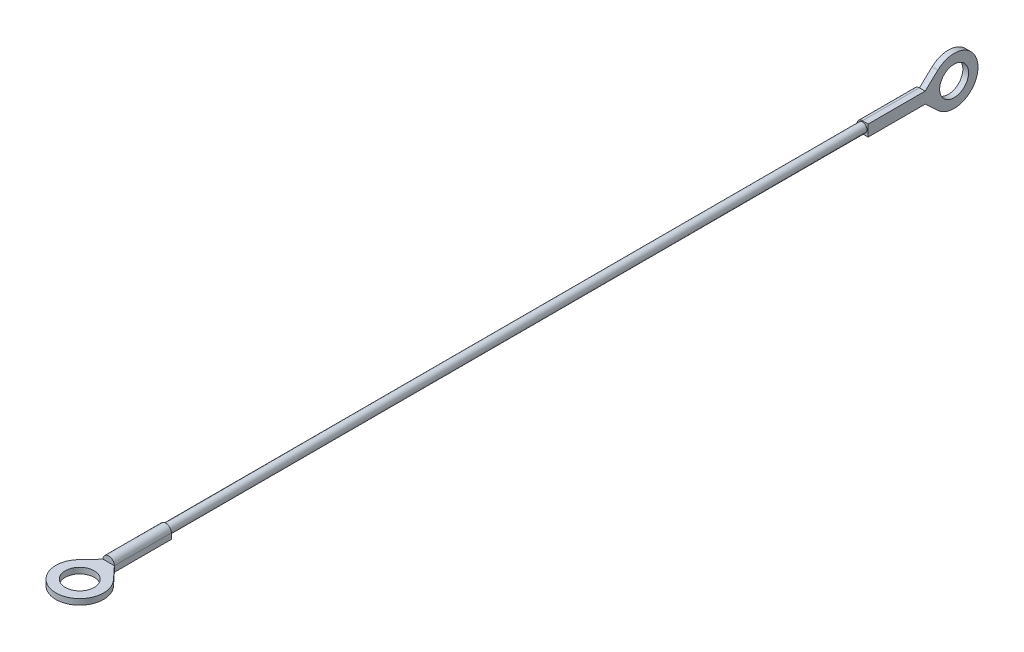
ISO-10303-21;
HEADER;
FILE_DESCRIPTION(('STEP AP214'),'2;1');
FILE_NAME('part.step','',(''),(''),'','','');
FILE_SCHEMA(('AUTOMOTIVE_DESIGN { 1 0 10303 214 1 1 1 1 }'));
ENDSEC;
DATA;
#1=APPLICATION_CONTEXT('core data for automotive mechanical design processes');
#2=APPLICATION_PROTOCOL_DEFINITION('international standard','automotive_design',2000,#1);
#3=PRODUCT_CONTEXT('',#1,'mechanical');
#4=PRODUCT('Part','Part','',(#3));
#5=PRODUCT_RELATED_PRODUCT_CATEGORY('part','',(#4));
#6=PRODUCT_DEFINITION_FORMATION('','',#4);
#7=PRODUCT_DEFINITION_CONTEXT('part definition',#1,'design');
#8=PRODUCT_DEFINITION('design','',#6,#7);
#9=PRODUCT_DEFINITION_SHAPE('','',#8);
#10=(LENGTH_UNIT() NAMED_UNIT(*) SI_UNIT(.MILLI.,.METRE.));
#11=(NAMED_UNIT(*) PLANE_ANGLE_UNIT() SI_UNIT($,.RADIAN.));
#12=(NAMED_UNIT(*) SI_UNIT($,.STERADIAN.) SOLID_ANGLE_UNIT());
#13=UNCERTAINTY_MEASURE_WITH_UNIT(LENGTH_MEASURE(1.E-05),#10,'distance_accuracy_value','');
#14=(GEOMETRIC_REPRESENTATION_CONTEXT(3) GLOBAL_UNCERTAINTY_ASSIGNED_CONTEXT((#13)) GLOBAL_UNIT_ASSIGNED_CONTEXT((#10,
#11,#12)) REPRESENTATION_CONTEXT('',''));
#15=CARTESIAN_POINT('',(0.,0.,0.));
#16=DIRECTION('',(0.,0.,1.));
#17=DIRECTION('',(1.,0.,0.));
#18=AXIS2_PLACEMENT_3D('',#15,#16,#17);
#19=CARTESIAN_POINT('',(0.,0.,-71.12));
#20=DIRECTION('',(0.,0.,-1.));
#21=DIRECTION('',(-1.,0.,0.));
#22=AXIS2_PLACEMENT_3D('',#19,#20,#21);
#23=PLANE('',#22);
#24=CARTESIAN_POINT('',(0.,-0.995,-71.12));
#25=CARTESIAN_POINT('',(-0.411702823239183,-0.995,-71.12));
#26=CARTESIAN_POINT('',(-0.703571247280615,-0.703571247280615,-71.12));
#27=CARTESIAN_POINT('',(-0.994688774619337,-0.412892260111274,-71.12));
#28=CARTESIAN_POINT('',(-0.995,0.,-71.12));
#29=CARTESIAN_POINT('',(-0.995310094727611,0.411392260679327,-71.12));
#30=CARTESIAN_POINT('',(-0.703571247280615,0.703571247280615,-71.12));
#31=CARTESIAN_POINT('',(-0.41258150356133,0.995,-71.12));
#32=CARTESIAN_POINT('',(0.,0.995,-71.12));
#33=B_SPLINE_CURVE_WITH_KNOTS('',2,(#24,#25,#26,#27,#28,#29,#30,#31,#32),.UNSPECIFIED.,.F.,.F.,
(3,2,2,2,3),(0.,0.25,0.5,0.75,1.),.UNSPECIFIED.);
#34=CARTESIAN_POINT('',(-0.00750000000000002,-0.995,-71.12));
#35=VERTEX_POINT('',#34);
#36=CARTESIAN_POINT('',(-0.00750000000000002,0.995,-71.12));
#37=VERTEX_POINT('',#36);
#38=EDGE_CURVE('E181',#35,#37,#33,.T.);
#39=ORIENTED_EDGE('',*,*,#38,.T.);
#40=DIRECTION('',(0.,-1.,0.));
#41=VECTOR('',#40,1.);
#42=CARTESIAN_POINT('',(-0.015,-0.995,-71.12));
#43=LINE('',#42,#41);
#44=EDGE_CURVE('E138',#37,#35,#43,.T.);
#45=ORIENTED_EDGE('',*,*,#44,.T.);
#46=EDGE_LOOP('',(#39,#45));
#47=FACE_BOUND('',#46,.T.);
#48=ADVANCED_FACE('F39',(#47),#23,.T.);
#49=CARTESIAN_POINT('',(0.,0.,71.12));
#50=DIRECTION('',(0.,0.,1.));
#51=DIRECTION('',(1.,0.,0.));
#52=AXIS2_PLACEMENT_3D('',#49,#50,#51);
#53=PLANE('',#52);
#54=CARTESIAN_POINT('',(0.995,0.,71.12));
#55=CARTESIAN_POINT('',(0.995,0.411702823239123,71.12));
#56=CARTESIAN_POINT('',(0.703571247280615,0.703571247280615,71.12));
#57=CARTESIAN_POINT('',(0.412892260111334,0.994688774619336,71.12));
#58=CARTESIAN_POINT('',(0.,0.995,71.12));
#59=CARTESIAN_POINT('',(-0.411392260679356,0.995310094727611,71.12));
#60=CARTESIAN_POINT('',(-0.703571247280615,0.703571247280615,71.12));
#61=CARTESIAN_POINT('',(-0.995,0.412581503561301,71.12));
#62=CARTESIAN_POINT('',(-0.995,0.,71.12));
#63=B_SPLINE_CURVE_WITH_KNOTS('',2,(#54,#55,#56,#57,#58,#59,#60,#61,#62),.UNSPECIFIED.,.F.,.F.,
(3,2,2,2,3),(0.,0.25,0.5,0.75,1.),.UNSPECIFIED.);
#64=CARTESIAN_POINT('',(0.995,0.00749999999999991,71.12));
#65=VERTEX_POINT('',#64);
#66=CARTESIAN_POINT('',(-0.995,0.00749999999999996,71.12));
#67=VERTEX_POINT('',#66);
#68=EDGE_CURVE('E275',#65,#67,#63,.T.);
#69=ORIENTED_EDGE('',*,*,#68,.T.);
#70=DIRECTION('',(1.,0.,0.));
#71=VECTOR('',#70,1.);
#72=CARTESIAN_POINT('',(-0.995,0.015,71.12));
#73=LINE('',#72,#71);
#74=EDGE_CURVE('E229',#67,#65,#73,.T.);
#75=ORIENTED_EDGE('',*,*,#74,.T.);
#76=EDGE_LOOP('',(#69,#75));
#77=FACE_BOUND('',#76,.T.);
#78=ADVANCED_FACE('F252',(#77),#53,.T.);
#79=CARTESIAN_POINT('',(0.,0.,61.12));
#80=DIRECTION('',(0.,0.,-1.));
#81=DIRECTION('',(-1.,0.,0.));
#82=AXIS2_PLACEMENT_3D('',#79,#80,#81);
#83=CYLINDRICAL_SURFACE('',#82,0.795);
#84=CARTESIAN_POINT('',(0.,0.,61.12));
#85=DIRECTION('',(0.,0.,1.));
#86=DIRECTION('',(1.,0.,0.));
#87=AXIS2_PLACEMENT_3D('',#84,#85,#86);
#88=CIRCLE('',#87,0.795);
#89=CARTESIAN_POINT('',(0.795,0.,61.12));
#90=VERTEX_POINT('',#89);
#91=EDGE_CURVE('E11',#90,#90,#88,.T.);
#92=ORIENTED_EDGE('',*,*,#91,.F.);
#93=EDGE_LOOP('',(#92));
#94=FACE_BOUND('',#93,.T.);
#95=CARTESIAN_POINT('',(0.,0.,-61.12));
#96=DIRECTION('',(0.,0.,1.));
#97=DIRECTION('',(1.,0.,0.));
#98=AXIS2_PLACEMENT_3D('',#95,#96,#97);
#99=CIRCLE('',#98,0.795);
#100=CARTESIAN_POINT('',(0.795,0.,-61.12));
#101=VERTEX_POINT('',#100);
#102=EDGE_CURVE('E197',#101,#101,#99,.T.);
#103=ORIENTED_EDGE('',*,*,#102,.T.);
#104=EDGE_LOOP('',(#103));
#105=FACE_BOUND('',#104,.T.);
#106=ADVANCED_FACE('F41',(#94,#105),#83,.T.);
#107=CARTESIAN_POINT('',(0.,0.,71.12));
#108=DIRECTION('',(0.,0.,-1.));
#109=DIRECTION('',(-1.,0.,0.));
#110=AXIS2_PLACEMENT_3D('',#107,#108,#109);
#111=CYLINDRICAL_SURFACE('',#110,0.995);
#112=CARTESIAN_POINT('',(0.,0.,61.12));
#113=DIRECTION('',(0.,0.,1.));
#114=DIRECTION('',(1.,0.,0.));
#115=AXIS2_PLACEMENT_3D('',#112,#113,#114);
#116=CIRCLE('',#115,0.995);
#117=CARTESIAN_POINT('',(0.995,0.,61.12));
#118=VERTEX_POINT('',#117);
#119=CARTESIAN_POINT('',(-0.995,0.,61.12));
#120=VERTEX_POINT('',#119);
#121=EDGE_CURVE('E214',#118,#120,#116,.T.);
#122=ORIENTED_EDGE('',*,*,#121,.T.);
#123=DIRECTION('',(0.,0.,-1.));
#124=VECTOR('',#123,1.);
#125=CARTESIAN_POINT('',(-0.995,0.,71.12));
#126=LINE('',#125,#124);
#127=EDGE_CURVE('E50',#67,#120,#126,.T.);
#128=ORIENTED_EDGE('',*,*,#127,.F.);
#129=ORIENTED_EDGE('',*,*,#68,.F.);
#130=DIRECTION('',(0.,0.,-1.));
#131=VECTOR('',#130,1.);
#132=CARTESIAN_POINT('',(0.995,0.,71.12));
#133=LINE('',#132,#131);
#134=EDGE_CURVE('E406',#65,#118,#133,.T.);
#135=ORIENTED_EDGE('',*,*,#134,.T.);
#136=EDGE_LOOP('',(#122,#128,#129,#135));
#137=FACE_BOUND('',#136,.T.);
#138=ADVANCED_FACE('F281',(#137),#111,.T.);
#139=CARTESIAN_POINT('',(-0.995,0.,71.12));
#140=DIRECTION('',(1.,0.,0.));
#141=DIRECTION('',(0.,1.,0.));
#142=AXIS2_PLACEMENT_3D('',#139,#140,#141);
#143=PLANE('',#142);
#144=DIRECTION('',(0.,-1.,0.));
#145=VECTOR('',#144,1.);
#146=CARTESIAN_POINT('',(-0.995,0.,61.12));
#147=LINE('',#146,#145);
#148=CARTESIAN_POINT('',(-0.995,-0.995,61.12));
#149=VERTEX_POINT('',#148);
#150=EDGE_CURVE('E492',#120,#149,#147,.T.);
#151=ORIENTED_EDGE('',*,*,#150,.T.);
#152=DIRECTION('',(0.,0.,-1.));
#153=VECTOR('',#152,1.);
#154=CARTESIAN_POINT('',(-0.995,-0.995,71.12));
#155=LINE('',#154,#153);
#156=CARTESIAN_POINT('',(-0.995,-0.995,71.12));
#157=VERTEX_POINT('',#156);
#158=EDGE_CURVE('E302',#157,#149,#155,.T.);
#159=ORIENTED_EDGE('',*,*,#158,.F.);
#160=CARTESIAN_POINT('',(-0.995,0.015,71.12));
#161=DIRECTION('',(0.,-1.,0.));
#162=VECTOR('',#161,1.);
#163=LINE('',#160,#162);
#164=EDGE_CURVE('E223',#67,#157,#163,.T.);
#165=ORIENTED_EDGE('',*,*,#164,.F.);
#166=ORIENTED_EDGE('',*,*,#127,.T.);
#167=EDGE_LOOP('',(#151,#159,#165,#166));
#168=FACE_BOUND('',#167,.T.);
#169=ADVANCED_FACE('F290',(#168),#143,.F.);
#170=CARTESIAN_POINT('',(0.,-0.995,71.12));
#171=DIRECTION('',(0.,1.,0.));
#172=DIRECTION('',(0.,0.,1.));
#173=AXIS2_PLACEMENT_3D('',#170,#171,#172);
#174=PLANE('',#173);
#175=DIRECTION('',(1.,0.,0.));
#176=VECTOR('',#175,1.);
#177=CARTESIAN_POINT('',(0.,-0.995,61.12));
#178=LINE('',#177,#176);
#179=CARTESIAN_POINT('',(0.995,-0.995,61.12));
#180=VERTEX_POINT('',#179);
#181=EDGE_CURVE('E484',#149,#180,#178,.T.);
#182=ORIENTED_EDGE('',*,*,#181,.T.);
#183=DIRECTION('',(0.,0.,-1.));
#184=VECTOR('',#183,1.);
#185=CARTESIAN_POINT('',(0.995,-0.995,71.12));
#186=LINE('',#185,#184);
#187=CARTESIAN_POINT('',(0.995,-0.995,71.12));
#188=VERTEX_POINT('',#187);
#189=EDGE_CURVE('E311',#188,#180,#186,.T.);
#190=ORIENTED_EDGE('',*,*,#189,.F.);
#191=DIRECTION('',(0.681456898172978,0.,0.731858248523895));
#192=VECTOR('',#191,1.);
#193=CARTESIAN_POINT('',(0.995,-0.995,71.12));
#194=LINE('',#193,#192);
#195=CARTESIAN_POINT('',(3.06648606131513,-0.995,73.3446955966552));
#196=VERTEX_POINT('',#195);
#197=EDGE_CURVE('E192',#188,#196,#194,.T.);
#198=ORIENTED_EDGE('',*,*,#197,.T.);
#199=CARTESIAN_POINT('',(0.,-0.995,76.2));
#200=DIRECTION('',(0.,-1.,0.));
#201=DIRECTION('',(0.,0.,-1.));
#202=AXIS2_PLACEMENT_3D('',#199,#200,#201);
#203=CIRCLE('',#202,4.19000000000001);
#204=CARTESIAN_POINT('',(-3.06648606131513,-0.995,73.3446955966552));
#205=VERTEX_POINT('',#204);
#206=EDGE_CURVE('E206',#196,#205,#203,.T.);
#207=ORIENTED_EDGE('',*,*,#206,.T.);
#208=DIRECTION('',(0.681456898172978,0.,-0.731858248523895));
#209=VECTOR('',#208,1.);
#210=CARTESIAN_POINT('',(-3.06648606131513,-0.995,73.3446955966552));
#211=LINE('',#210,#209);
#212=EDGE_CURVE('E210',#205,#157,#211,.T.);
#213=ORIENTED_EDGE('',*,*,#212,.T.);
#214=ORIENTED_EDGE('',*,*,#158,.T.);
#215=EDGE_LOOP('',(#182,#190,#198,#207,#213,#214));
#216=FACE_BOUND('',#215,.T.);
#217=CARTESIAN_POINT('',(0.,-0.995,76.2));
#218=DIRECTION('',(0.,-1.,0.));
#219=DIRECTION('',(0.,0.,-1.));
#220=AXIS2_PLACEMENT_3D('',#217,#218,#219);
#221=CIRCLE('',#220,2.53999999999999);
#222=CARTESIAN_POINT('',(0.,-0.995,73.66));
#223=VERTEX_POINT('',#222);
#224=EDGE_CURVE('E193',#223,#223,#221,.T.);
#225=ORIENTED_EDGE('',*,*,#224,.F.);
#226=EDGE_LOOP('',(#225));
#227=FACE_BOUND('',#226,.T.);
#228=ADVANCED_FACE('F294',(#216,#227),#174,.F.);
#229=CARTESIAN_POINT('',(0.995,-0.995,71.12));
#230=DIRECTION('',(-1.,0.,0.));
#231=DIRECTION('',(0.,-1.,0.));
#232=AXIS2_PLACEMENT_3D('',#229,#230,#231);
#233=PLANE('',#232);
#234=DIRECTION('',(0.,1.,0.));
#235=VECTOR('',#234,1.);
#236=CARTESIAN_POINT('',(0.995,-0.995,61.12));
#237=LINE('',#236,#235);
#238=EDGE_CURVE('E491',#180,#118,#237,.T.);
#239=ORIENTED_EDGE('',*,*,#238,.T.);
#240=ORIENTED_EDGE('',*,*,#134,.F.);
#241=DIRECTION('',(0.,1.,0.));
#242=VECTOR('',#241,1.);
#243=CARTESIAN_POINT('',(0.995,-0.995,71.12));
#244=LINE('',#243,#242);
#245=EDGE_CURVE('E279',#188,#65,#244,.T.);
#246=ORIENTED_EDGE('',*,*,#245,.F.);
#247=ORIENTED_EDGE('',*,*,#189,.T.);
#248=EDGE_LOOP('',(#239,#240,#246,#247));
#249=FACE_BOUND('',#248,.T.);
#250=ADVANCED_FACE('F477',(#249),#233,.F.);
#251=CARTESIAN_POINT('',(0.,0.,61.12));
#252=DIRECTION('',(0.,0.,1.));
#253=DIRECTION('',(1.,0.,0.));
#254=AXIS2_PLACEMENT_3D('',#251,#252,#253);
#255=PLANE('',#254);
#256=ORIENTED_EDGE('',*,*,#91,.T.);
#257=EDGE_LOOP('',(#256));
#258=FACE_BOUND('',#257,.T.);
#259=ORIENTED_EDGE('',*,*,#121,.F.);
#260=ORIENTED_EDGE('',*,*,#238,.F.);
#261=ORIENTED_EDGE('',*,*,#181,.F.);
#262=ORIENTED_EDGE('',*,*,#150,.F.);
#263=EDGE_LOOP('',(#259,#260,#261,#262));
#264=FACE_BOUND('',#263,.T.);
#265=ADVANCED_FACE('F242',(#258,#264),#255,.F.);
#266=CARTESIAN_POINT('',(-3.06648606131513,0.015,73.3446955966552));
#267=DIRECTION('',(-0.731858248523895,0.,-0.681456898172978));
#268=DIRECTION('',(-0.681456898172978,0.,0.731858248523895));
#269=AXIS2_PLACEMENT_3D('',#266,#267,#268);
#270=PLANE('',#269);
#271=ORIENTED_EDGE('',*,*,#212,.F.);
#272=DIRECTION('',(0.,-1.,0.));
#273=VECTOR('',#272,1.);
#274=CARTESIAN_POINT('',(-3.06648606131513,0.015,73.3446955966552));
#275=LINE('',#274,#273);
#276=CARTESIAN_POINT('',(-3.06648606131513,0.015,73.3446955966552));
#277=VERTEX_POINT('',#276);
#278=EDGE_CURVE('E211',#277,#205,#275,.T.);
#279=ORIENTED_EDGE('',*,*,#278,.F.);
#280=DIRECTION('',(0.681456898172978,0.,-0.731858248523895));
#281=VECTOR('',#280,1.);
#282=CARTESIAN_POINT('',(-3.06648606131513,0.015,73.3446955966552));
#283=LINE('',#282,#281);
#284=EDGE_CURVE('E202',#277,#67,#283,.T.);
#285=ORIENTED_EDGE('',*,*,#284,.T.);
#286=ORIENTED_EDGE('',*,*,#164,.T.);
#287=EDGE_LOOP('',(#271,#279,#285,#286));
#288=FACE_BOUND('',#287,.T.);
#289=ADVANCED_FACE('F231',(#288),#270,.T.);
#290=CARTESIAN_POINT('',(0.,0.015,76.2));
#291=DIRECTION('',(0.,-1.,0.));
#292=DIRECTION('',(0.,0.,-1.));
#293=AXIS2_PLACEMENT_3D('',#290,#291,#292);
#294=CYLINDRICAL_SURFACE('',#293,4.19000000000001);
#295=ORIENTED_EDGE('',*,*,#206,.F.);
#296=DIRECTION('',(0.,-1.,0.));
#297=VECTOR('',#296,1.);
#298=CARTESIAN_POINT('',(3.06648606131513,0.015,73.3446955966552));
#299=LINE('',#298,#297);
#300=CARTESIAN_POINT('',(3.06648606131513,0.015,73.3446955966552));
#301=VERTEX_POINT('',#300);
#302=EDGE_CURVE('E215',#301,#196,#299,.T.);
#303=ORIENTED_EDGE('',*,*,#302,.F.);
#304=CARTESIAN_POINT('',(0.,0.015,76.2));
#305=DIRECTION('',(0.,-1.,0.));
#306=DIRECTION('',(0.,0.,-1.));
#307=AXIS2_PLACEMENT_3D('',#304,#305,#306);
#308=CIRCLE('',#307,4.19000000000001);
#309=EDGE_CURVE('E198',#301,#277,#308,.T.);
#310=ORIENTED_EDGE('',*,*,#309,.T.);
#311=ORIENTED_EDGE('',*,*,#278,.T.);
#312=EDGE_LOOP('',(#295,#303,#310,#311));
#313=FACE_BOUND('',#312,.T.);
#314=ADVANCED_FACE('F241',(#313),#294,.T.);
#315=CARTESIAN_POINT('',(0.995,0.015,71.12));
#316=DIRECTION('',(0.731858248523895,0.,-0.681456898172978));
#317=DIRECTION('',(-0.681456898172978,0.,-0.731858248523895));
#318=AXIS2_PLACEMENT_3D('',#315,#316,#317);
#319=PLANE('',#318);
#320=ORIENTED_EDGE('',*,*,#197,.F.);
#321=ORIENTED_EDGE('',*,*,#245,.T.);
#322=DIRECTION('',(0.681456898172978,0.,0.731858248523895));
#323=VECTOR('',#322,1.);
#324=CARTESIAN_POINT('',(0.995,0.015,71.12));
#325=LINE('',#324,#323);
#326=EDGE_CURVE('E58',#65,#301,#325,.T.);
#327=ORIENTED_EDGE('',*,*,#326,.T.);
#328=ORIENTED_EDGE('',*,*,#302,.T.);
#329=EDGE_LOOP('',(#320,#321,#327,#328));
#330=FACE_BOUND('',#329,.T.);
#331=ADVANCED_FACE('F247',(#330),#319,.T.);
#332=CARTESIAN_POINT('',(0.,0.015,76.2));
#333=DIRECTION('',(0.,-1.,0.));
#334=DIRECTION('',(0.,0.,-1.));
#335=AXIS2_PLACEMENT_3D('',#332,#333,#334);
#336=PLANE('',#335);
#337=CARTESIAN_POINT('',(0.,0.015,76.2));
#338=DIRECTION('',(0.,-1.,0.));
#339=DIRECTION('',(0.,0.,-1.));
#340=AXIS2_PLACEMENT_3D('',#337,#338,#339);
#341=CIRCLE('',#340,2.53999999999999);
#342=CARTESIAN_POINT('',(0.,0.015,73.66));
#343=VERTEX_POINT('',#342);
#344=EDGE_CURVE('E188',#343,#343,#341,.T.);
#345=ORIENTED_EDGE('',*,*,#344,.T.);
#346=EDGE_LOOP('',(#345));
#347=FACE_BOUND('',#346,.T.);
#348=ORIENTED_EDGE('',*,*,#74,.F.);
#349=ORIENTED_EDGE('',*,*,#284,.F.);
#350=ORIENTED_EDGE('',*,*,#309,.F.);
#351=ORIENTED_EDGE('',*,*,#326,.F.);
#352=EDGE_LOOP('',(#348,#349,#350,#351));
#353=FACE_BOUND('',#352,.T.);
#354=ADVANCED_FACE('F243',(#347,#353),#336,.F.);
#355=CARTESIAN_POINT('',(0.,0.015,76.2));
#356=DIRECTION('',(0.,-1.,0.));
#357=DIRECTION('',(0.,0.,-1.));
#358=AXIS2_PLACEMENT_3D('',#355,#356,#357);
#359=CYLINDRICAL_SURFACE('',#358,2.53999999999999);
#360=ORIENTED_EDGE('',*,*,#344,.F.);
#361=EDGE_LOOP('',(#360));
#362=FACE_BOUND('',#361,.T.);
#363=ORIENTED_EDGE('',*,*,#224,.T.);
#364=EDGE_LOOP('',(#363));
#365=FACE_BOUND('',#364,.T.);
#366=ADVANCED_FACE('F463',(#362,#365),#359,.F.);
#367=CARTESIAN_POINT('',(0.,0.,-71.12));
#368=DIRECTION('',(0.,0.,1.));
#369=DIRECTION('',(1.,0.,0.));
#370=AXIS2_PLACEMENT_3D('',#367,#368,#369);
#371=CYLINDRICAL_SURFACE('',#370,0.995);
#372=CARTESIAN_POINT('',(0.,0.,-61.12));
#373=DIRECTION('',(0.,0.,-1.));
#374=DIRECTION('',(-1.,0.,0.));
#375=AXIS2_PLACEMENT_3D('',#372,#373,#374);
#376=CIRCLE('',#375,0.995);
#377=CARTESIAN_POINT('',(0.,-0.995,-61.12));
#378=VERTEX_POINT('',#377);
#379=CARTESIAN_POINT('',(0.,0.995,-61.12));
#380=VERTEX_POINT('',#379);
#381=EDGE_CURVE('E167',#378,#380,#376,.T.);
#382=ORIENTED_EDGE('',*,*,#381,.T.);
#383=DIRECTION('',(0.,0.,1.));
#384=VECTOR('',#383,1.);
#385=CARTESIAN_POINT('',(0.,0.995,-71.12));
#386=LINE('',#385,#384);
#387=EDGE_CURVE('E366',#37,#380,#386,.T.);
#388=ORIENTED_EDGE('',*,*,#387,.F.);
#389=ORIENTED_EDGE('',*,*,#38,.F.);
#390=DIRECTION('',(0.,0.,1.));
#391=VECTOR('',#390,1.);
#392=CARTESIAN_POINT('',(0.,-0.995,-71.12));
#393=LINE('',#392,#391);
#394=EDGE_CURVE('E187',#35,#378,#393,.T.);
#395=ORIENTED_EDGE('',*,*,#394,.T.);
#396=EDGE_LOOP('',(#382,#388,#389,#395));
#397=FACE_BOUND('',#396,.T.);
#398=ADVANCED_FACE('F350',(#397),#371,.T.);
#399=CARTESIAN_POINT('',(0.,0.995,-71.12));
#400=DIRECTION('',(0.,-1.,0.));
#401=DIRECTION('',(0.,0.,-1.));
#402=AXIS2_PLACEMENT_3D('',#399,#400,#401);
#403=PLANE('',#402);
#404=DIRECTION('',(1.,0.,0.));
#405=VECTOR('',#404,1.);
#406=CARTESIAN_POINT('',(0.,0.995,-61.12));
#407=LINE('',#406,#405);
#408=CARTESIAN_POINT('',(0.995,0.995,-61.12));
#409=VERTEX_POINT('',#408);
#410=EDGE_CURVE('E171',#380,#409,#407,.T.);
#411=ORIENTED_EDGE('',*,*,#410,.T.);
#412=DIRECTION('',(0.,0.,1.));
#413=VECTOR('',#412,1.);
#414=CARTESIAN_POINT('',(0.995,0.995,-71.12));
#415=LINE('',#414,#413);
#416=CARTESIAN_POINT('',(0.995,0.995,-71.12));
#417=VERTEX_POINT('',#416);
#418=EDGE_CURVE('E186',#417,#409,#415,.T.);
#419=ORIENTED_EDGE('',*,*,#418,.F.);
#420=CARTESIAN_POINT('',(-0.015,0.995,-71.12));
#421=DIRECTION('',(1.,0.,0.));
#422=VECTOR('',#421,1.);
#423=LINE('',#420,#422);
#424=EDGE_CURVE('E387',#37,#417,#423,.T.);
#425=ORIENTED_EDGE('',*,*,#424,.F.);
#426=ORIENTED_EDGE('',*,*,#387,.T.);
#427=EDGE_LOOP('',(#411,#419,#425,#426));
#428=FACE_BOUND('',#427,.T.);
#429=ADVANCED_FACE('F345',(#428),#403,.F.);
#430=CARTESIAN_POINT('',(0.995,0.,-71.12));
#431=DIRECTION('',(-1.,0.,0.));
#432=DIRECTION('',(0.,-1.,0.));
#433=AXIS2_PLACEMENT_3D('',#430,#431,#432);
#434=PLANE('',#433);
#435=DIRECTION('',(0.,-1.,0.));
#436=VECTOR('',#435,1.);
#437=CARTESIAN_POINT('',(0.995,0.,-61.12));
#438=LINE('',#437,#436);
#439=CARTESIAN_POINT('',(0.995,-0.995,-61.12));
#440=VERTEX_POINT('',#439);
#441=EDGE_CURVE('E175',#409,#440,#438,.T.);
#442=ORIENTED_EDGE('',*,*,#441,.T.);
#443=DIRECTION('',(0.,0.,1.));
#444=VECTOR('',#443,1.);
#445=CARTESIAN_POINT('',(0.995,-0.995,-71.12));
#446=LINE('',#445,#444);
#447=CARTESIAN_POINT('',(0.995,-0.995,-71.12));
#448=VERTEX_POINT('',#447);
#449=EDGE_CURVE('E182',#448,#440,#446,.T.);
#450=ORIENTED_EDGE('',*,*,#449,.F.);
#451=DIRECTION('',(0.,-0.681456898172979,-0.731858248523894));
#452=VECTOR('',#451,1.);
#453=CARTESIAN_POINT('',(0.995,-3.06648606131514,-73.3446955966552));
#454=LINE('',#453,#452);
#455=CARTESIAN_POINT('',(0.995,-3.06648606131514,-73.3446955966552));
#456=VERTEX_POINT('',#455);
#457=EDGE_CURVE('E409',#448,#456,#454,.T.);
#458=ORIENTED_EDGE('',*,*,#457,.T.);
#459=CARTESIAN_POINT('',(0.995,0.,-76.2));
#460=DIRECTION('',(1.,0.,0.));
#461=DIRECTION('',(0.,0.,1.));
#462=AXIS2_PLACEMENT_3D('',#459,#460,#461);
#463=CIRCLE('',#462,4.19000000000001);
#464=CARTESIAN_POINT('',(0.995,3.06648606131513,-73.3446955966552));
#465=VERTEX_POINT('',#464);
#466=EDGE_CURVE('E132',#456,#465,#463,.T.);
#467=ORIENTED_EDGE('',*,*,#466,.T.);
#468=DIRECTION('',(0.,-0.681456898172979,0.731858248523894));
#469=VECTOR('',#468,1.);
#470=CARTESIAN_POINT('',(0.995,0.995,-71.12));
#471=LINE('',#470,#469);
#472=EDGE_CURVE('E155',#465,#417,#471,.T.);
#473=ORIENTED_EDGE('',*,*,#472,.T.);
#474=ORIENTED_EDGE('',*,*,#418,.T.);
#475=EDGE_LOOP('',(#442,#450,#458,#467,#473,#474));
#476=FACE_BOUND('',#475,.T.);
#477=CARTESIAN_POINT('',(0.995,0.,-76.2));
#478=DIRECTION('',(1.,0.,0.));
#479=DIRECTION('',(0.,0.,-1.));
#480=AXIS2_PLACEMENT_3D('',#477,#478,#479);
#481=CIRCLE('',#480,2.54);
#482=CARTESIAN_POINT('',(0.995,0.,-78.74));
#483=VERTEX_POINT('',#482);
#484=EDGE_CURVE('E447',#483,#483,#481,.T.);
#485=ORIENTED_EDGE('',*,*,#484,.F.);
#486=EDGE_LOOP('',(#485));
#487=FACE_BOUND('',#486,.T.);
#488=ADVANCED_FACE('F341',(#476,#487),#434,.F.);
#489=CARTESIAN_POINT('',(0.995,-0.995,-71.12));
#490=DIRECTION('',(0.,1.,0.));
#491=DIRECTION('',(0.,0.,1.));
#492=AXIS2_PLACEMENT_3D('',#489,#490,#491);
#493=PLANE('',#492);
#494=DIRECTION('',(-1.,0.,0.));
#495=VECTOR('',#494,1.);
#496=CARTESIAN_POINT('',(0.995,-0.995,-61.12));
#497=LINE('',#496,#495);
#498=EDGE_CURVE('E178',#440,#378,#497,.T.);
#499=ORIENTED_EDGE('',*,*,#498,.T.);
#500=ORIENTED_EDGE('',*,*,#394,.F.);
#501=DIRECTION('',(-1.,0.,0.));
#502=VECTOR('',#501,1.);
#503=CARTESIAN_POINT('',(0.995,-0.995,-71.12));
#504=LINE('',#503,#502);
#505=EDGE_CURVE('E152',#448,#35,#504,.T.);
#506=ORIENTED_EDGE('',*,*,#505,.F.);
#507=ORIENTED_EDGE('',*,*,#449,.T.);
#508=EDGE_LOOP('',(#499,#500,#506,#507));
#509=FACE_BOUND('',#508,.T.);
#510=ADVANCED_FACE('F337',(#509),#493,.F.);
#511=CARTESIAN_POINT('',(0.,0.,-61.12));
#512=DIRECTION('',(0.,0.,-1.));
#513=DIRECTION('',(-1.,0.,0.));
#514=AXIS2_PLACEMENT_3D('',#511,#512,#513);
#515=PLANE('',#514);
#516=ORIENTED_EDGE('',*,*,#102,.F.);
#517=EDGE_LOOP('',(#516));
#518=FACE_BOUND('',#517,.T.);
#519=ORIENTED_EDGE('',*,*,#381,.F.);
#520=ORIENTED_EDGE('',*,*,#498,.F.);
#521=ORIENTED_EDGE('',*,*,#441,.F.);
#522=ORIENTED_EDGE('',*,*,#410,.F.);
#523=EDGE_LOOP('',(#519,#520,#521,#522));
#524=FACE_BOUND('',#523,.T.);
#525=ADVANCED_FACE('F334',(#518,#524),#515,.F.);
#526=CARTESIAN_POINT('',(-0.015,-3.06648606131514,-73.3446955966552));
#527=DIRECTION('',(0.,-0.731858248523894,0.681456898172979));
#528=DIRECTION('',(0.,-0.681456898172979,-0.731858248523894));
#529=AXIS2_PLACEMENT_3D('',#526,#527,#528);
#530=PLANE('',#529);
#531=ORIENTED_EDGE('',*,*,#457,.F.);
#532=ORIENTED_EDGE('',*,*,#505,.T.);
#533=DIRECTION('',(0.,-0.681456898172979,-0.731858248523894));
#534=VECTOR('',#533,1.);
#535=CARTESIAN_POINT('',(-0.015,-3.06648606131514,-73.3446955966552));
#536=LINE('',#535,#534);
#537=CARTESIAN_POINT('',(-0.015,-3.06648606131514,-73.3446955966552));
#538=VERTEX_POINT('',#537);
#539=EDGE_CURVE('E145',#35,#538,#536,.T.);
#540=ORIENTED_EDGE('',*,*,#539,.T.);
#541=DIRECTION('',(1.,0.,0.));
#542=VECTOR('',#541,1.);
#543=CARTESIAN_POINT('',(-0.015,-3.06648606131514,-73.3446955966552));
#544=LINE('',#543,#542);
#545=EDGE_CURVE('E127',#538,#456,#544,.T.);
#546=ORIENTED_EDGE('',*,*,#545,.T.);
#547=EDGE_LOOP('',(#531,#532,#540,#546));
#548=FACE_BOUND('',#547,.T.);
#549=ADVANCED_FACE('F150',(#548),#530,.T.);
#550=CARTESIAN_POINT('',(-0.015,0.995,-71.12));
#551=DIRECTION('',(0.,0.731858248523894,0.681456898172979));
#552=DIRECTION('',(0.,-0.681456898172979,0.731858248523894));
#553=AXIS2_PLACEMENT_3D('',#550,#551,#552);
#554=PLANE('',#553);
#555=ORIENTED_EDGE('',*,*,#472,.F.);
#556=DIRECTION('',(1.,0.,0.));
#557=VECTOR('',#556,1.);
#558=CARTESIAN_POINT('',(-0.015,3.06648606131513,-73.3446955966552));
#559=LINE('',#558,#557);
#560=CARTESIAN_POINT('',(-0.015,3.06648606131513,-73.3446955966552));
#561=VERTEX_POINT('',#560);
#562=EDGE_CURVE('E137',#561,#465,#559,.T.);
#563=ORIENTED_EDGE('',*,*,#562,.F.);
#564=DIRECTION('',(0.,-0.681456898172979,0.731858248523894));
#565=VECTOR('',#564,1.);
#566=CARTESIAN_POINT('',(-0.015,0.995,-71.12));
#567=LINE('',#566,#565);
#568=EDGE_CURVE('E147',#561,#37,#567,.T.);
#569=ORIENTED_EDGE('',*,*,#568,.T.);
#570=ORIENTED_EDGE('',*,*,#424,.T.);
#571=EDGE_LOOP('',(#555,#563,#569,#570));
#572=FACE_BOUND('',#571,.T.);
#573=ADVANCED_FACE('F424',(#572),#554,.T.);
#574=CARTESIAN_POINT('',(-0.015,0.,-76.2));
#575=DIRECTION('',(1.,0.,0.));
#576=DIRECTION('',(0.,0.,-1.));
#577=AXIS2_PLACEMENT_3D('',#574,#575,#576);
#578=CYLINDRICAL_SURFACE('',#577,4.19000000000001);
#579=ORIENTED_EDGE('',*,*,#466,.F.);
#580=ORIENTED_EDGE('',*,*,#545,.F.);
#581=CARTESIAN_POINT('',(-0.015,0.,-76.2));
#582=DIRECTION('',(1.,0.,0.));
#583=DIRECTION('',(0.,0.,1.));
#584=AXIS2_PLACEMENT_3D('',#581,#582,#583);
#585=CIRCLE('',#584,4.19000000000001);
#586=EDGE_CURVE('E130',#538,#561,#585,.T.);
#587=ORIENTED_EDGE('',*,*,#586,.T.);
#588=ORIENTED_EDGE('',*,*,#562,.T.);
#589=EDGE_LOOP('',(#579,#580,#587,#588));
#590=FACE_BOUND('',#589,.T.);
#591=ADVANCED_FACE('F129',(#590),#578,.T.);
#592=CARTESIAN_POINT('',(-0.015,0.,-76.2));
#593=DIRECTION('',(-1.,0.,0.));
#594=DIRECTION('',(0.,0.,1.));
#595=AXIS2_PLACEMENT_3D('',#592,#593,#594);
#596=PLANE('',#595);
#597=CARTESIAN_POINT('',(-0.015,0.,-76.2));
#598=DIRECTION('',(1.,0.,0.));
#599=DIRECTION('',(0.,0.,-1.));
#600=AXIS2_PLACEMENT_3D('',#597,#598,#599);
#601=CIRCLE('',#600,2.54);
#602=CARTESIAN_POINT('',(-0.015,0.,-78.74));
#603=VERTEX_POINT('',#602);
#604=EDGE_CURVE('E410',#603,#603,#601,.T.);
#605=ORIENTED_EDGE('',*,*,#604,.T.);
#606=EDGE_LOOP('',(#605));
#607=FACE_BOUND('',#606,.T.);
#608=ORIENTED_EDGE('',*,*,#539,.F.);
#609=ORIENTED_EDGE('',*,*,#44,.F.);
#610=ORIENTED_EDGE('',*,*,#568,.F.);
#611=ORIENTED_EDGE('',*,*,#586,.F.);
#612=EDGE_LOOP('',(#608,#609,#610,#611));
#613=FACE_BOUND('',#612,.T.);
#614=ADVANCED_FACE('F143',(#607,#613),#596,.T.);
#615=CARTESIAN_POINT('',(-0.015,0.,-76.2));
#616=DIRECTION('',(1.,0.,0.));
#617=DIRECTION('',(0.,0.,-1.));
#618=AXIS2_PLACEMENT_3D('',#615,#616,#617);
#619=CYLINDRICAL_SURFACE('',#618,2.54);
#620=ORIENTED_EDGE('',*,*,#604,.F.);
#621=EDGE_LOOP('',(#620));
#622=FACE_BOUND('',#621,.T.);
#623=ORIENTED_EDGE('',*,*,#484,.T.);
#624=EDGE_LOOP('',(#623));
#625=FACE_BOUND('',#624,.T.);
#626=ADVANCED_FACE('F438',(#622,#625),#619,.F.);
#627=CLOSED_SHELL('',(#48,#78,#106,#138,#169,#228,#250,#265,#289,#314,#331,#354,#366,#398,#429,
#488,#510,#525,#549,#573,#591,#614,#626));
#628=MANIFOLD_SOLID_BREP('B2',#627);
#629=ADVANCED_BREP_SHAPE_REPRESENTATION('',(#18,#628),#14);
#630=SHAPE_DEFINITION_REPRESENTATION(#9,#629);
ENDSEC;
END-ISO-10303-21;
